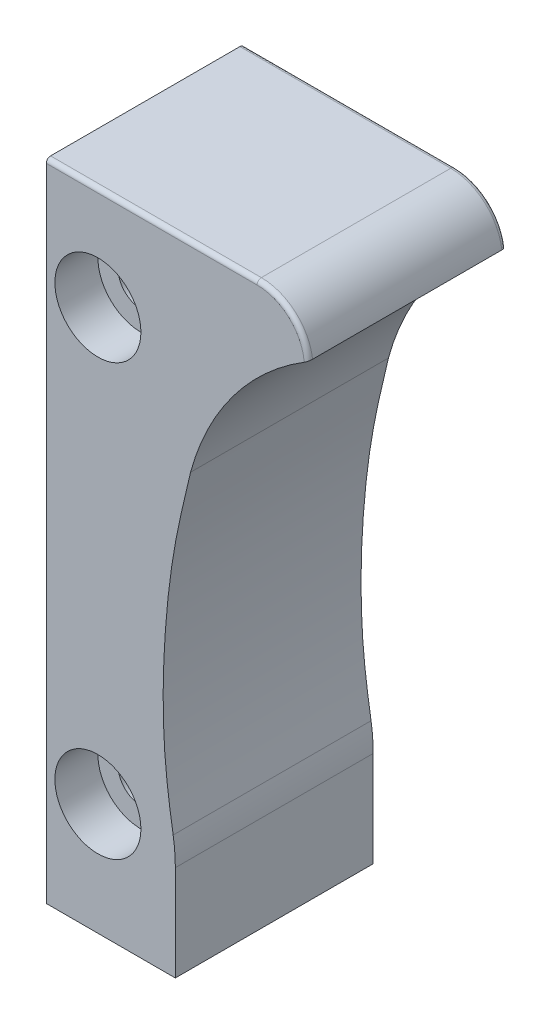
ISO-10303-21;
HEADER;
FILE_DESCRIPTION(('STEP AP214'),'2;1');
FILE_NAME('part.step','',(''),(''),'','','');
FILE_SCHEMA(('AUTOMOTIVE_DESIGN { 1 0 10303 214 1 1 1 1 }'));
ENDSEC;
DATA;
#1=APPLICATION_CONTEXT('core data for automotive mechanical design processes');
#2=APPLICATION_PROTOCOL_DEFINITION('international standard','automotive_design',2000,#1);
#3=PRODUCT_CONTEXT('',#1,'mechanical');
#4=PRODUCT('Part','Part','',(#3));
#5=PRODUCT_RELATED_PRODUCT_CATEGORY('part','',(#4));
#6=PRODUCT_DEFINITION_FORMATION('','',#4);
#7=PRODUCT_DEFINITION_CONTEXT('part definition',#1,'design');
#8=PRODUCT_DEFINITION('design','',#6,#7);
#9=PRODUCT_DEFINITION_SHAPE('','',#8);
#10=(LENGTH_UNIT() NAMED_UNIT(*) SI_UNIT(.MILLI.,.METRE.));
#11=(NAMED_UNIT(*) PLANE_ANGLE_UNIT() SI_UNIT($,.RADIAN.));
#12=(NAMED_UNIT(*) SI_UNIT($,.STERADIAN.) SOLID_ANGLE_UNIT());
#13=UNCERTAINTY_MEASURE_WITH_UNIT(LENGTH_MEASURE(1.E-05),#10,'distance_accuracy_value','');
#14=(GEOMETRIC_REPRESENTATION_CONTEXT(3) GLOBAL_UNCERTAINTY_ASSIGNED_CONTEXT((#13)) GLOBAL_UNIT_ASSIGNED_CONTEXT((#10,
#11,#12)) REPRESENTATION_CONTEXT('',''));
#15=CARTESIAN_POINT('',(0.,0.,0.));
#16=DIRECTION('',(0.,0.,1.));
#17=DIRECTION('',(1.,0.,0.));
#18=AXIS2_PLACEMENT_3D('',#15,#16,#17);
#19=CARTESIAN_POINT('',(24.5,69.,0.));
#20=DIRECTION('',(0.,0.,-1.));
#21=DIRECTION('',(-1.,0.,0.));
#22=AXIS2_PLACEMENT_3D('',#19,#20,#21);
#23=PLANE('',#22);
#24=CARTESIAN_POINT('',(5.99999999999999,13.,0.));
#25=DIRECTION('',(0.,0.,-1.));
#26=DIRECTION('',(-1.,0.,0.));
#27=AXIS2_PLACEMENT_3D('',#24,#25,#26);
#28=CIRCLE('',#27,4.99999999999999);
#29=CARTESIAN_POINT('',(1.,13.,0.));
#30=VERTEX_POINT('',#29);
#31=EDGE_CURVE('E614',#30,#30,#28,.T.);
#32=ORIENTED_EDGE('',*,*,#31,.F.);
#33=EDGE_LOOP('',(#32));
#34=FACE_BOUND('',#33,.T.);
#35=CARTESIAN_POINT('',(5.99999999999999,63.,0.));
#36=DIRECTION('',(0.,0.,-1.));
#37=DIRECTION('',(-1.,0.,0.));
#38=AXIS2_PLACEMENT_3D('',#35,#36,#37);
#39=CIRCLE('',#38,4.99999999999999);
#40=CARTESIAN_POINT('',(1.,63.,0.));
#41=VERTEX_POINT('',#40);
#42=EDGE_CURVE('E623',#41,#41,#39,.T.);
#43=ORIENTED_EDGE('',*,*,#42,.F.);
#44=EDGE_LOOP('',(#43));
#45=FACE_BOUND('',#44,.T.);
#46=CARTESIAN_POINT('',(16.769,51.79,0.));
#47=CARTESIAN_POINT('',(16.0926851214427,48.9656163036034,0.));
#48=CARTESIAN_POINT('',(14.6876697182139,43.0980792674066,0.));
#49=CARTESIAN_POINT('',(13.5098852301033,32.437096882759,0.));
#50=CARTESIAN_POINT('',(13.4642107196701,22.137856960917,0.));
#51=CARTESIAN_POINT('',(14.6088868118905,15.1139351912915,0.));
#52=CARTESIAN_POINT('',(15.,12.714,0.));
#53=B_SPLINE_CURVE_WITH_KNOTS('',3,(#46,#47,#48,#49,#50,#51,#52),.UNSPECIFIED.,.F.,.F.,(4,1,1,1,
4),(0.,0.220835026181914,0.458775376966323,0.8150742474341,1.),.UNSPECIFIED.);
#54=CARTESIAN_POINT('',(16.769,51.79,0.));
#55=VERTEX_POINT('',#54);
#56=CARTESIAN_POINT('',(14.7480328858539,14.2687484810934,0.));
#57=VERTEX_POINT('',#56);
#58=EDGE_CURVE('E467',#55,#57,#53,.T.);
#59=ORIENTED_EDGE('',*,*,#58,.T.);
#60=CARTESIAN_POINT('',(-4.99999999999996,11.1040688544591,0.));
#61=DIRECTION('',(0.,0.,-1.));
#62=DIRECTION('',(-1.,0.,0.));
#63=AXIS2_PLACEMENT_3D('',#60,#61,#62);
#64=CIRCLE('',#63,20.);
#65=CARTESIAN_POINT('',(15.,11.1040688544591,0.));
#66=VERTEX_POINT('',#65);
#67=EDGE_CURVE('E370',#57,#66,#64,.T.);
#68=ORIENTED_EDGE('',*,*,#67,.T.);
#69=DIRECTION('',(0.,-1.,0.));
#70=VECTOR('',#69,1.);
#71=CARTESIAN_POINT('',(15.,69.,0.));
#72=LINE('',#71,#70);
#73=CARTESIAN_POINT('',(15.,0.,0.));
#74=VERTEX_POINT('',#73);
#75=EDGE_CURVE('E471',#66,#74,#72,.T.);
#76=ORIENTED_EDGE('',*,*,#75,.T.);
#77=DIRECTION('',(1.,0.,0.));
#78=VECTOR('',#77,1.);
#79=CARTESIAN_POINT('',(0.,0.,0.));
#80=LINE('',#79,#78);
#81=CARTESIAN_POINT('',(0.,0.,0.));
#82=VERTEX_POINT('',#81);
#83=EDGE_CURVE('E444',#82,#74,#80,.T.);
#84=ORIENTED_EDGE('',*,*,#83,.F.);
#85=DIRECTION('',(0.,-1.,0.));
#86=VECTOR('',#85,1.);
#87=CARTESIAN_POINT('',(0.,0.,0.));
#88=LINE('',#87,#86);
#89=CARTESIAN_POINT('',(0.,74.5,0.));
#90=VERTEX_POINT('',#89);
#91=EDGE_CURVE('E445',#90,#82,#88,.T.);
#92=ORIENTED_EDGE('',*,*,#91,.F.);
#93=DIRECTION('',(-1.,0.,0.));
#94=VECTOR('',#93,1.);
#95=CARTESIAN_POINT('',(24.5,74.5,0.));
#96=LINE('',#95,#94);
#97=CARTESIAN_POINT('',(24.5,74.5,0.));
#98=VERTEX_POINT('',#97);
#99=EDGE_CURVE('E680',#90,#98,#96,.F.);
#100=ORIENTED_EDGE('',*,*,#99,.T.);
#101=CARTESIAN_POINT('',(24.5,69.,0.));
#102=DIRECTION('',(0.,0.,-1.));
#103=DIRECTION('',(-1.,0.,0.));
#104=AXIS2_PLACEMENT_3D('',#101,#102,#103);
#105=CIRCLE('',#104,5.5);
#106=CARTESIAN_POINT('',(29.9798054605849,69.4708843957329,0.));
#107=VERTEX_POINT('',#106);
#108=EDGE_CURVE('E679',#98,#107,#105,.T.);
#109=ORIENTED_EDGE('',*,*,#108,.T.);
#110=CARTESIAN_POINT('',(45.7218219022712,43.9328946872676,0.));
#111=DIRECTION('',(0.,0.,-1.));
#112=DIRECTION('',(-1.,0.,0.));
#113=AXIS2_PLACEMENT_3D('',#110,#111,#112);
#114=CIRCLE('',#113,30.);
#115=EDGE_CURVE('E465',#107,#55,#114,.F.);
#116=ORIENTED_EDGE('',*,*,#115,.T.);
#117=EDGE_LOOP('',(#59,#68,#76,#84,#92,#100,#109,#116));
#118=FACE_BOUND('',#117,.T.);
#119=ADVANCED_FACE('F348',(#34,#45,#118),#23,.T.);
#120=CARTESIAN_POINT('',(0.,0.,23.));
#121=DIRECTION('',(0.,1.,0.));
#122=DIRECTION('',(0.,0.,1.));
#123=AXIS2_PLACEMENT_3D('',#120,#121,#122);
#124=PLANE('',#123);
#125=DIRECTION('',(0.,0.,-1.));
#126=VECTOR('',#125,1.);
#127=CARTESIAN_POINT('',(15.,0.,23.));
#128=LINE('',#127,#126);
#129=CARTESIAN_POINT('',(15.,0.,23.));
#130=VERTEX_POINT('',#129);
#131=EDGE_CURVE('E430',#130,#74,#128,.T.);
#132=ORIENTED_EDGE('',*,*,#131,.F.);
#133=DIRECTION('',(1.,0.,0.));
#134=VECTOR('',#133,1.);
#135=CARTESIAN_POINT('',(0.,0.,23.));
#136=LINE('',#135,#134);
#137=CARTESIAN_POINT('',(0.,0.,23.));
#138=VERTEX_POINT('',#137);
#139=EDGE_CURVE('E441',#138,#130,#136,.T.);
#140=ORIENTED_EDGE('',*,*,#139,.F.);
#141=DIRECTION('',(0.,0.,-1.));
#142=VECTOR('',#141,1.);
#143=CARTESIAN_POINT('',(0.,0.,23.));
#144=LINE('',#143,#142);
#145=EDGE_CURVE('E463',#138,#82,#144,.T.);
#146=ORIENTED_EDGE('',*,*,#145,.T.);
#147=ORIENTED_EDGE('',*,*,#83,.T.);
#148=EDGE_LOOP('',(#132,#140,#146,#147));
#149=FACE_BOUND('',#148,.T.);
#150=ADVANCED_FACE('F439',(#149),#124,.F.);
#151=CARTESIAN_POINT('',(24.5,69.,23.));
#152=DIRECTION('',(0.,0.,-1.));
#153=DIRECTION('',(-1.,0.,0.));
#154=AXIS2_PLACEMENT_3D('',#151,#152,#153);
#155=PLANE('',#154);
#156=CARTESIAN_POINT('',(5.99999999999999,13.,23.));
#157=DIRECTION('',(0.,0.,1.));
#158=DIRECTION('',(1.,0.,0.));
#159=AXIS2_PLACEMENT_3D('',#156,#157,#158);
#160=CIRCLE('',#159,4.99999999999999);
#161=CARTESIAN_POINT('',(11.,13.,23.));
#162=VERTEX_POINT('',#161);
#163=EDGE_CURVE('E632',#162,#162,#160,.T.);
#164=ORIENTED_EDGE('',*,*,#163,.F.);
#165=EDGE_LOOP('',(#164));
#166=FACE_BOUND('',#165,.T.);
#167=CARTESIAN_POINT('',(5.99999999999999,63.,23.));
#168=DIRECTION('',(0.,0.,1.));
#169=DIRECTION('',(1.,0.,0.));
#170=AXIS2_PLACEMENT_3D('',#167,#168,#169);
#171=CIRCLE('',#170,4.99999999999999);
#172=CARTESIAN_POINT('',(11.,63.,23.));
#173=VERTEX_POINT('',#172);
#174=EDGE_CURVE('E641',#173,#173,#171,.T.);
#175=ORIENTED_EDGE('',*,*,#174,.F.);
#176=EDGE_LOOP('',(#175));
#177=FACE_BOUND('',#176,.T.);
#178=DIRECTION('',(0.,-1.,0.));
#179=VECTOR('',#178,1.);
#180=CARTESIAN_POINT('',(15.,12.714,23.));
#181=LINE('',#180,#179);
#182=CARTESIAN_POINT('',(15.,11.1040688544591,23.));
#183=VERTEX_POINT('',#182);
#184=EDGE_CURVE('E427',#183,#130,#181,.T.);
#185=ORIENTED_EDGE('',*,*,#184,.F.);
#186=CARTESIAN_POINT('',(-4.99999999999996,11.1040688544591,23.));
#187=DIRECTION('',(0.,0.,-1.));
#188=DIRECTION('',(-1.,0.,0.));
#189=AXIS2_PLACEMENT_3D('',#186,#187,#188);
#190=CIRCLE('',#189,20.);
#191=CARTESIAN_POINT('',(14.7480328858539,14.2687484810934,23.));
#192=VERTEX_POINT('',#191);
#193=EDGE_CURVE('E11',#183,#192,#190,.F.);
#194=ORIENTED_EDGE('',*,*,#193,.T.);
#195=CARTESIAN_POINT('',(16.769,51.79,23.));
#196=CARTESIAN_POINT('',(16.0926851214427,48.9656163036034,23.));
#197=CARTESIAN_POINT('',(14.6876697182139,43.0980792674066,23.));
#198=CARTESIAN_POINT('',(13.5098852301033,32.437096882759,23.));
#199=CARTESIAN_POINT('',(13.4642107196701,22.137856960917,23.));
#200=CARTESIAN_POINT('',(14.6088868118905,15.1139351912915,23.));
#201=CARTESIAN_POINT('',(15.,12.714,23.));
#202=B_SPLINE_CURVE_WITH_KNOTS('',3,(#195,#196,#197,#198,#199,#200,#201),.UNSPECIFIED.,.F.,.F.,
(4,1,1,1,4),(0.,0.220835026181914,0.458775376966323,0.8150742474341,1.),.UNSPECIFIED.);
#203=CARTESIAN_POINT('',(16.769,51.79,23.));
#204=VERTEX_POINT('',#203);
#205=EDGE_CURVE('E435',#204,#192,#202,.T.);
#206=ORIENTED_EDGE('',*,*,#205,.F.);
#207=CARTESIAN_POINT('',(45.7218219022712,43.9328946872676,23.));
#208=DIRECTION('',(0.,0.,1.));
#209=DIRECTION('',(1.,0.,0.));
#210=AXIS2_PLACEMENT_3D('',#207,#208,#209);
#211=CIRCLE('',#210,30.);
#212=CARTESIAN_POINT('',(29.9798054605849,69.4708843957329,23.));
#213=VERTEX_POINT('',#212);
#214=EDGE_CURVE('E643',#213,#204,#211,.T.);
#215=ORIENTED_EDGE('',*,*,#214,.F.);
#216=CARTESIAN_POINT('',(24.5,69.,23.));
#217=DIRECTION('',(0.,0.,-1.));
#218=DIRECTION('',(-1.,0.,0.));
#219=AXIS2_PLACEMENT_3D('',#216,#217,#218);
#220=CIRCLE('',#219,5.5);
#221=CARTESIAN_POINT('',(24.5,74.5,23.));
#222=VERTEX_POINT('',#221);
#223=EDGE_CURVE('E478',#213,#222,#220,.F.);
#224=ORIENTED_EDGE('',*,*,#223,.T.);
#225=DIRECTION('',(-1.,0.,0.));
#226=VECTOR('',#225,1.);
#227=CARTESIAN_POINT('',(24.5,74.5,23.));
#228=LINE('',#227,#226);
#229=CARTESIAN_POINT('',(0.,74.5,23.));
#230=VERTEX_POINT('',#229);
#231=EDGE_CURVE('E476',#222,#230,#228,.T.);
#232=ORIENTED_EDGE('',*,*,#231,.T.);
#233=DIRECTION('',(0.,-1.,0.));
#234=VECTOR('',#233,1.);
#235=CARTESIAN_POINT('',(0.,0.,23.));
#236=LINE('',#235,#234);
#237=EDGE_CURVE('E449',#230,#138,#236,.T.);
#238=ORIENTED_EDGE('',*,*,#237,.T.);
#239=ORIENTED_EDGE('',*,*,#139,.T.);
#240=EDGE_LOOP('',(#185,#194,#206,#215,#224,#232,#238,#239));
#241=FACE_BOUND('',#240,.T.);
#242=ADVANCED_FACE('F447',(#166,#177,#241),#155,.F.);
#243=CARTESIAN_POINT('',(0.,0.,23.));
#244=DIRECTION('',(1.,0.,0.));
#245=DIRECTION('',(0.,0.,-1.));
#246=AXIS2_PLACEMENT_3D('',#243,#244,#245);
#247=PLANE('',#246);
#248=ORIENTED_EDGE('',*,*,#237,.F.);
#249=CARTESIAN_POINT('',(0.,74.5,22.5));
#250=DIRECTION('',(1.,0.,0.));
#251=DIRECTION('',(0.,0.,-1.));
#252=AXIS2_PLACEMENT_3D('',#249,#250,#251);
#253=CIRCLE('',#252,0.5);
#254=CARTESIAN_POINT('',(0.,75.,22.5));
#255=VERTEX_POINT('',#254);
#256=EDGE_CURVE('E675',#230,#255,#253,.F.);
#257=ORIENTED_EDGE('',*,*,#256,.T.);
#258=DIRECTION('',(0.,0.,-1.));
#259=VECTOR('',#258,1.);
#260=CARTESIAN_POINT('',(0.,75.,23.));
#261=LINE('',#260,#259);
#262=CARTESIAN_POINT('',(0.,75.,0.5));
#263=VERTEX_POINT('',#262);
#264=EDGE_CURVE('E450',#255,#263,#261,.T.);
#265=ORIENTED_EDGE('',*,*,#264,.T.);
#266=CARTESIAN_POINT('',(0.,74.5,0.5));
#267=DIRECTION('',(1.,0.,0.));
#268=DIRECTION('',(0.,0.,-1.));
#269=AXIS2_PLACEMENT_3D('',#266,#267,#268);
#270=CIRCLE('',#269,0.5);
#271=EDGE_CURVE('E677',#263,#90,#270,.F.);
#272=ORIENTED_EDGE('',*,*,#271,.T.);
#273=ORIENTED_EDGE('',*,*,#91,.T.);
#274=ORIENTED_EDGE('',*,*,#145,.F.);
#275=EDGE_LOOP('',(#248,#257,#265,#272,#273,#274));
#276=FACE_BOUND('',#275,.T.);
#277=ADVANCED_FACE('F350',(#276),#247,.F.);
#278=CARTESIAN_POINT('',(24.5,69.,23.));
#279=DIRECTION('',(0.,0.,-1.));
#280=DIRECTION('',(-1.,0.,0.));
#281=AXIS2_PLACEMENT_3D('',#278,#279,#280);
#282=CYLINDRICAL_SURFACE('',#281,6.);
#283=DIRECTION('',(0.,0.,-1.));
#284=VECTOR('',#283,1.);
#285=CARTESIAN_POINT('',(24.5,75.,23.));
#286=LINE('',#285,#284);
#287=CARTESIAN_POINT('',(24.5,75.,22.5));
#288=VERTEX_POINT('',#287);
#289=CARTESIAN_POINT('',(24.5,75.,0.5));
#290=VERTEX_POINT('',#289);
#291=EDGE_CURVE('E453',#288,#290,#286,.T.);
#292=ORIENTED_EDGE('',*,*,#291,.F.);
#293=CARTESIAN_POINT('',(24.5,69.,22.5));
#294=DIRECTION('',(0.,0.,-1.));
#295=DIRECTION('',(-1.,0.,0.));
#296=AXIS2_PLACEMENT_3D('',#293,#294,#295);
#297=CIRCLE('',#296,6.);
#298=CARTESIAN_POINT('',(30.4521692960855,69.7560956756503,22.5));
#299=VERTEX_POINT('',#298);
#300=EDGE_CURVE('E484',#288,#299,#297,.T.);
#301=ORIENTED_EDGE('',*,*,#300,.T.);
#302=DIRECTION('',(0.,0.,-1.));
#303=VECTOR('',#302,1.);
#304=CARTESIAN_POINT('',(30.4521692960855,69.7560956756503,23.));
#305=LINE('',#304,#303);
#306=CARTESIAN_POINT('',(30.4521692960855,69.7560956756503,0.5));
#307=VERTEX_POINT('',#306);
#308=EDGE_CURVE('E460',#299,#307,#305,.T.);
#309=ORIENTED_EDGE('',*,*,#308,.T.);
#310=CARTESIAN_POINT('',(24.5,69.,0.5));
#311=DIRECTION('',(0.,0.,-1.));
#312=DIRECTION('',(-1.,0.,0.));
#313=AXIS2_PLACEMENT_3D('',#310,#311,#312);
#314=CIRCLE('',#313,6.);
#315=EDGE_CURVE('E481',#307,#290,#314,.F.);
#316=ORIENTED_EDGE('',*,*,#315,.T.);
#317=EDGE_LOOP('',(#292,#301,#309,#316));
#318=FACE_BOUND('',#317,.T.);
#319=ADVANCED_FACE('F584',(#318),#282,.T.);
#320=CARTESIAN_POINT('',(0.,75.,23.));
#321=DIRECTION('',(0.,-1.,0.));
#322=DIRECTION('',(0.,0.,-1.));
#323=AXIS2_PLACEMENT_3D('',#320,#321,#322);
#324=PLANE('',#323);
#325=ORIENTED_EDGE('',*,*,#264,.F.);
#326=DIRECTION('',(-1.,0.,0.));
#327=VECTOR('',#326,1.);
#328=CARTESIAN_POINT('',(0.,75.,22.5));
#329=LINE('',#328,#327);
#330=EDGE_CURVE('E603',#255,#288,#329,.F.);
#331=ORIENTED_EDGE('',*,*,#330,.T.);
#332=ORIENTED_EDGE('',*,*,#291,.T.);
#333=DIRECTION('',(-1.,0.,0.));
#334=VECTOR('',#333,1.);
#335=CARTESIAN_POINT('',(0.,75.,0.5));
#336=LINE('',#335,#334);
#337=EDGE_CURVE('E671',#290,#263,#336,.T.);
#338=ORIENTED_EDGE('',*,*,#337,.T.);
#339=EDGE_LOOP('',(#325,#331,#332,#338));
#340=FACE_BOUND('',#339,.T.);
#341=ADVANCED_FACE('F566',(#340),#324,.F.);
#342=CARTESIAN_POINT('',(15.,12.714,23.));
#343=DIRECTION('',(1.,0.,0.));
#344=DIRECTION('',(0.,1.,0.));
#345=AXIS2_PLACEMENT_3D('',#342,#343,#344);
#346=PLANE('',#345);
#347=ORIENTED_EDGE('',*,*,#75,.F.);
#348=DIRECTION('',(0.,0.,-1.));
#349=VECTOR('',#348,1.);
#350=CARTESIAN_POINT('',(15.,11.1040688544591,23.));
#351=LINE('',#350,#349);
#352=EDGE_CURVE('E356',#66,#183,#351,.F.);
#353=ORIENTED_EDGE('',*,*,#352,.T.);
#354=ORIENTED_EDGE('',*,*,#184,.T.);
#355=ORIENTED_EDGE('',*,*,#131,.T.);
#356=EDGE_LOOP('',(#347,#353,#354,#355));
#357=FACE_BOUND('',#356,.T.);
#358=ADVANCED_FACE('F429',(#357),#346,.T.);
#359=DIRECTION('',(0.,0.,-1.));
#360=VECTOR('',#359,1.);
#361=SURFACE_OF_LINEAR_EXTRUSION('',#202,#360);
#362=ORIENTED_EDGE('',*,*,#205,.T.);
#363=DIRECTION('',(0.,0.,-1.));
#364=VECTOR('',#363,1.);
#365=CARTESIAN_POINT('',(14.7480328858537,14.2687484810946,23.));
#366=LINE('',#365,#364);
#367=EDGE_CURVE('E665',#192,#57,#366,.T.);
#368=ORIENTED_EDGE('',*,*,#367,.T.);
#369=ORIENTED_EDGE('',*,*,#58,.F.);
#370=DIRECTION('',(0.,0.,-1.));
#371=VECTOR('',#370,1.);
#372=CARTESIAN_POINT('',(16.769,51.79,23.));
#373=LINE('',#372,#371);
#374=EDGE_CURVE('E646',#204,#55,#373,.T.);
#375=ORIENTED_EDGE('',*,*,#374,.F.);
#376=EDGE_LOOP('',(#362,#368,#369,#375));
#377=FACE_BOUND('',#376,.T.);
#378=ADVANCED_FACE('F564',(#377),#361,.T.);
#379=CARTESIAN_POINT('',(45.7218219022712,43.9328946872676,23.));
#380=DIRECTION('',(0.,0.,-1.));
#381=DIRECTION('',(-1.,0.,0.));
#382=AXIS2_PLACEMENT_3D('',#379,#380,#381);
#383=CYLINDRICAL_SURFACE('',#382,30.);
#384=ORIENTED_EDGE('',*,*,#308,.F.);
#385=CARTESIAN_POINT('',(30.4521692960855,69.7560956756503,22.5));
#386=CARTESIAN_POINT('',(30.452197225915,69.7561110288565,22.5264099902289));
#387=CARTESIAN_POINT('',(30.4502093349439,69.7549367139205,22.5528011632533));
#388=CARTESIAN_POINT('',(30.4424201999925,69.7503291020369,22.6047379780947));
#389=CARTESIAN_POINT('',(30.4366298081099,69.746902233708,22.6302858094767));
#390=CARTESIAN_POINT('',(30.4214535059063,69.737909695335,22.6798806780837));
#391=CARTESIAN_POINT('',(30.4120684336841,69.7323445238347,22.7039280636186));
#392=CARTESIAN_POINT('',(30.3900684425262,69.7192767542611,22.7499301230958));
#393=CARTESIAN_POINT('',(30.3774522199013,69.7117733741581,22.7718839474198));
#394=CARTESIAN_POINT('',(30.3490020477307,69.6948179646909,22.8138365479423));
#395=CARTESIAN_POINT('',(30.3330818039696,69.6853135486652,22.8337554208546));
#396=CARTESIAN_POINT('',(30.2988055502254,69.6648002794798,22.8704673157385));
#397=CARTESIAN_POINT('',(30.2804491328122,69.653791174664,22.8872598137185));
#398=CARTESIAN_POINT('',(30.2403308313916,69.629665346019,22.9186435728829));
#399=CARTESIAN_POINT('',(30.218415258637,69.616451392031,22.9329632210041));
#400=CARTESIAN_POINT('',(30.1729930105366,69.5889783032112,22.9575233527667));
#401=CARTESIAN_POINT('',(30.1494849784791,69.5747182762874,22.9677603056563));
#402=CARTESIAN_POINT('',(30.1017936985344,69.5456938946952,22.9839728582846));
#403=CARTESIAN_POINT('',(30.077622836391,69.5309382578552,22.9900009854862));
#404=CARTESIAN_POINT('',(30.0288908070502,69.5010926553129,22.9980137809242));
#405=CARTESIAN_POINT('',(30.0043305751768,69.4860034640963,23.0000069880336));
#406=CARTESIAN_POINT('',(29.9798054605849,69.4708843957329,23.));
#407=B_SPLINE_CURVE_WITH_KNOTS('',3,(#385,#386,#387,#388,#389,#390,#391,#392,#393,#394,#395,
#396,#397,#398,#399,#400,#401,#402,#403,#404,#405,#406),.UNSPECIFIED.,.F.,.F.,(4,2,2,2,2,2,2,2,
2,2,4),(0.,0.0791000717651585,0.157975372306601,0.236832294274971,0.315721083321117,
0.397012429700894,0.478317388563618,0.565926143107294,0.653610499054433,0.740179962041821,
0.826566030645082),.UNSPECIFIED.);
#408=EDGE_CURVE('E493',#299,#213,#407,.T.);
#409=ORIENTED_EDGE('',*,*,#408,.T.);
#410=ORIENTED_EDGE('',*,*,#214,.T.);
#411=ORIENTED_EDGE('',*,*,#374,.T.);
#412=ORIENTED_EDGE('',*,*,#115,.F.);
#413=CARTESIAN_POINT('',(29.9798054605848,69.4708843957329,0.));
#414=CARTESIAN_POINT('',(30.008568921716,69.4886173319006,-1.48751817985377E-05));
#415=CARTESIAN_POINT('',(30.0373895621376,69.5063131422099,0.0027322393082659));
#416=CARTESIAN_POINT('',(30.094406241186,69.5411934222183,0.0137796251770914));
#417=CARTESIAN_POINT('',(30.1225996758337,69.5583758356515,0.0220997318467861));
#418=CARTESIAN_POINT('',(30.1774691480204,69.5916970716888,0.0443485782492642));
#419=CARTESIAN_POINT('',(30.2041414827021,69.6078333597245,0.0582903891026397));
#420=CARTESIAN_POINT('',(30.2548897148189,69.6384365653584,0.0915984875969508));
#421=CARTESIAN_POINT('',(30.278969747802,69.6529061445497,0.110955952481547));
#422=CARTESIAN_POINT('',(30.3218979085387,69.6786307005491,0.153088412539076));
#423=CARTESIAN_POINT('',(30.3410008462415,69.6900440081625,0.175506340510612));
#424=CARTESIAN_POINT('',(30.3753077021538,69.7104993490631,0.224121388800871));
#425=CARTESIAN_POINT('',(30.3905119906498,69.7195416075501,0.250318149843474));
#426=CARTESIAN_POINT('',(30.4150167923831,69.7340942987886,0.302977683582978));
#427=CARTESIAN_POINT('',(30.4247449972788,69.7398610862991,0.32917161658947));
#428=CARTESIAN_POINT('',(30.4399484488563,69.7488669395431,0.383153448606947));
#429=CARTESIAN_POINT('',(30.4454322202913,69.7521110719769,0.410938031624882));
#430=CARTESIAN_POINT('',(30.4498364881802,69.7547161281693,0.449142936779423));
#431=CARTESIAN_POINT('',(30.4507113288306,69.7552335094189,0.459295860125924));
#432=CARTESIAN_POINT('',(30.4518769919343,69.7559228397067,0.4796307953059));
#433=CARTESIAN_POINT('',(30.4521687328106,69.7560953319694,0.489812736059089));
#434=CARTESIAN_POINT('',(30.4521692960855,69.7560956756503,0.499999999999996));
#435=B_SPLINE_CURVE_WITH_KNOTS('',3,(#413,#414,#415,#416,#417,#418,#419,#420,#421,#422,#423,
#424,#425,#426,#427,#428,#429,#430,#431,#432,#433,#434),.UNSPECIFIED.,.F.,.F.,(4,2,2,2,2,2,2,2,
2,2,4),(0.,0.101306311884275,0.20297512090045,0.304881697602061,0.406623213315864,
0.500865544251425,0.595098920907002,0.680252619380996,0.765234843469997,0.795828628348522,
0.826374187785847),.UNSPECIFIED.);
#436=EDGE_CURVE('E486',#107,#307,#435,.T.);
#437=ORIENTED_EDGE('',*,*,#436,.T.);
#438=EDGE_LOOP('',(#384,#409,#410,#411,#412,#437));
#439=FACE_BOUND('',#438,.T.);
#440=ADVANCED_FACE('F499',(#439),#383,.F.);
#441=CARTESIAN_POINT('',(5.99999999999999,63.,23.));
#442=DIRECTION('',(0.,0.,1.));
#443=DIRECTION('',(1.,0.,0.));
#444=AXIS2_PLACEMENT_3D('',#441,#442,#443);
#445=CYLINDRICAL_SURFACE('',#444,5.);
#446=CARTESIAN_POINT('',(5.99999999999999,63.,18.));
#447=DIRECTION('',(0.,0.,1.));
#448=DIRECTION('',(1.,0.,0.));
#449=AXIS2_PLACEMENT_3D('',#446,#447,#448);
#450=CIRCLE('',#449,5.);
#451=CARTESIAN_POINT('',(11.,63.,18.));
#452=VERTEX_POINT('',#451);
#453=EDGE_CURVE('E638',#452,#452,#450,.T.);
#454=ORIENTED_EDGE('',*,*,#453,.F.);
#455=EDGE_LOOP('',(#454));
#456=FACE_BOUND('',#455,.T.);
#457=ORIENTED_EDGE('',*,*,#174,.T.);
#458=EDGE_LOOP('',(#457));
#459=FACE_BOUND('',#458,.T.);
#460=ADVANCED_FACE('F556',(#456,#459),#445,.F.);
#461=CARTESIAN_POINT('',(8.65,63.,18.));
#462=DIRECTION('',(0.,0.,-1.));
#463=DIRECTION('',(-1.,0.,0.));
#464=AXIS2_PLACEMENT_3D('',#461,#462,#463);
#465=PLANE('',#464);
#466=CARTESIAN_POINT('',(5.99999999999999,63.,18.));
#467=DIRECTION('',(0.,0.,1.));
#468=DIRECTION('',(1.,0.,0.));
#469=AXIS2_PLACEMENT_3D('',#466,#467,#468);
#470=CIRCLE('',#469,2.65);
#471=CARTESIAN_POINT('',(8.65,63.,18.));
#472=VERTEX_POINT('',#471);
#473=EDGE_CURVE('E635',#472,#472,#470,.T.);
#474=ORIENTED_EDGE('',*,*,#473,.F.);
#475=EDGE_LOOP('',(#474));
#476=FACE_BOUND('',#475,.T.);
#477=ORIENTED_EDGE('',*,*,#453,.T.);
#478=EDGE_LOOP('',(#477));
#479=FACE_BOUND('',#478,.T.);
#480=ADVANCED_FACE('F553',(#476,#479),#465,.F.);
#481=CARTESIAN_POINT('',(5.99999999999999,63.,23.));
#482=DIRECTION('',(0.,0.,1.));
#483=DIRECTION('',(1.,0.,0.));
#484=AXIS2_PLACEMENT_3D('',#481,#482,#483);
#485=CYLINDRICAL_SURFACE('',#484,2.65);
#486=CARTESIAN_POINT('',(5.99999999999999,63.,5.));
#487=DIRECTION('',(0.,0.,-1.));
#488=DIRECTION('',(-1.,0.,0.));
#489=AXIS2_PLACEMENT_3D('',#486,#487,#488);
#490=CIRCLE('',#489,2.64999999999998);
#491=CARTESIAN_POINT('',(3.35000000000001,63.,5.));
#492=VERTEX_POINT('',#491);
#493=EDGE_CURVE('E617',#492,#492,#490,.T.);
#494=ORIENTED_EDGE('',*,*,#493,.T.);
#495=EDGE_LOOP('',(#494));
#496=FACE_BOUND('',#495,.T.);
#497=ORIENTED_EDGE('',*,*,#473,.T.);
#498=EDGE_LOOP('',(#497));
#499=FACE_BOUND('',#498,.T.);
#500=ADVANCED_FACE('F549',(#496,#499),#485,.F.);
#501=CARTESIAN_POINT('',(5.99999999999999,13.,23.));
#502=DIRECTION('',(0.,0.,1.));
#503=DIRECTION('',(1.,0.,0.));
#504=AXIS2_PLACEMENT_3D('',#501,#502,#503);
#505=CYLINDRICAL_SURFACE('',#504,5.);
#506=CARTESIAN_POINT('',(5.99999999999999,13.,18.));
#507=DIRECTION('',(0.,0.,1.));
#508=DIRECTION('',(1.,0.,0.));
#509=AXIS2_PLACEMENT_3D('',#506,#507,#508);
#510=CIRCLE('',#509,5.);
#511=CARTESIAN_POINT('',(11.,13.,18.));
#512=VERTEX_POINT('',#511);
#513=EDGE_CURVE('E629',#512,#512,#510,.T.);
#514=ORIENTED_EDGE('',*,*,#513,.F.);
#515=EDGE_LOOP('',(#514));
#516=FACE_BOUND('',#515,.T.);
#517=ORIENTED_EDGE('',*,*,#163,.T.);
#518=EDGE_LOOP('',(#517));
#519=FACE_BOUND('',#518,.T.);
#520=ADVANCED_FACE('F545',(#516,#519),#505,.F.);
#521=CARTESIAN_POINT('',(8.65,13.,18.));
#522=DIRECTION('',(0.,0.,-1.));
#523=DIRECTION('',(-1.,0.,0.));
#524=AXIS2_PLACEMENT_3D('',#521,#522,#523);
#525=PLANE('',#524);
#526=CARTESIAN_POINT('',(5.99999999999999,13.,18.));
#527=DIRECTION('',(0.,0.,1.));
#528=DIRECTION('',(1.,0.,0.));
#529=AXIS2_PLACEMENT_3D('',#526,#527,#528);
#530=CIRCLE('',#529,2.65);
#531=CARTESIAN_POINT('',(8.65,13.,18.));
#532=VERTEX_POINT('',#531);
#533=EDGE_CURVE('E626',#532,#532,#530,.T.);
#534=ORIENTED_EDGE('',*,*,#533,.F.);
#535=EDGE_LOOP('',(#534));
#536=FACE_BOUND('',#535,.T.);
#537=ORIENTED_EDGE('',*,*,#513,.T.);
#538=EDGE_LOOP('',(#537));
#539=FACE_BOUND('',#538,.T.);
#540=ADVANCED_FACE('F541',(#536,#539),#525,.F.);
#541=CARTESIAN_POINT('',(5.99999999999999,13.,23.));
#542=DIRECTION('',(0.,0.,1.));
#543=DIRECTION('',(1.,0.,0.));
#544=AXIS2_PLACEMENT_3D('',#541,#542,#543);
#545=CYLINDRICAL_SURFACE('',#544,2.65);
#546=CARTESIAN_POINT('',(5.99999999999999,13.,5.));
#547=DIRECTION('',(0.,0.,-1.));
#548=DIRECTION('',(-1.,0.,0.));
#549=AXIS2_PLACEMENT_3D('',#546,#547,#548);
#550=CIRCLE('',#549,2.64999999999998);
#551=CARTESIAN_POINT('',(3.35000000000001,13.,5.));
#552=VERTEX_POINT('',#551);
#553=EDGE_CURVE('E604',#552,#552,#550,.T.);
#554=ORIENTED_EDGE('',*,*,#553,.T.);
#555=EDGE_LOOP('',(#554));
#556=FACE_BOUND('',#555,.T.);
#557=ORIENTED_EDGE('',*,*,#533,.T.);
#558=EDGE_LOOP('',(#557));
#559=FACE_BOUND('',#558,.T.);
#560=ADVANCED_FACE('F537',(#556,#559),#545,.F.);
#561=CARTESIAN_POINT('',(5.99999999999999,63.,0.));
#562=DIRECTION('',(0.,0.,-1.));
#563=DIRECTION('',(-1.,0.,0.));
#564=AXIS2_PLACEMENT_3D('',#561,#562,#563);
#565=CYLINDRICAL_SURFACE('',#564,5.);
#566=CARTESIAN_POINT('',(5.99999999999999,63.,5.));
#567=DIRECTION('',(0.,0.,-1.));
#568=DIRECTION('',(-1.,0.,0.));
#569=AXIS2_PLACEMENT_3D('',#566,#567,#568);
#570=CIRCLE('',#569,5.);
#571=CARTESIAN_POINT('',(0.999999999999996,63.,5.));
#572=VERTEX_POINT('',#571);
#573=EDGE_CURVE('E620',#572,#572,#570,.T.);
#574=ORIENTED_EDGE('',*,*,#573,.F.);
#575=EDGE_LOOP('',(#574));
#576=FACE_BOUND('',#575,.T.);
#577=ORIENTED_EDGE('',*,*,#42,.T.);
#578=EDGE_LOOP('',(#577));
#579=FACE_BOUND('',#578,.T.);
#580=ADVANCED_FACE('F533',(#576,#579),#565,.F.);
#581=CARTESIAN_POINT('',(8.64999999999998,63.,5.));
#582=DIRECTION('',(0.,0.,1.));
#583=DIRECTION('',(1.,0.,0.));
#584=AXIS2_PLACEMENT_3D('',#581,#582,#583);
#585=PLANE('',#584);
#586=ORIENTED_EDGE('',*,*,#493,.F.);
#587=EDGE_LOOP('',(#586));
#588=FACE_BOUND('',#587,.T.);
#589=ORIENTED_EDGE('',*,*,#573,.T.);
#590=EDGE_LOOP('',(#589));
#591=FACE_BOUND('',#590,.T.);
#592=ADVANCED_FACE('F529',(#588,#591),#585,.F.);
#593=CARTESIAN_POINT('',(5.99999999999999,13.,0.));
#594=DIRECTION('',(0.,0.,-1.));
#595=DIRECTION('',(-1.,0.,0.));
#596=AXIS2_PLACEMENT_3D('',#593,#594,#595);
#597=CYLINDRICAL_SURFACE('',#596,5.);
#598=CARTESIAN_POINT('',(5.99999999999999,13.,5.));
#599=DIRECTION('',(0.,0.,-1.));
#600=DIRECTION('',(-1.,0.,0.));
#601=AXIS2_PLACEMENT_3D('',#598,#599,#600);
#602=CIRCLE('',#601,5.);
#603=CARTESIAN_POINT('',(0.999999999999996,13.,5.));
#604=VERTEX_POINT('',#603);
#605=EDGE_CURVE('E608',#604,#604,#602,.T.);
#606=ORIENTED_EDGE('',*,*,#605,.F.);
#607=EDGE_LOOP('',(#606));
#608=FACE_BOUND('',#607,.T.);
#609=ORIENTED_EDGE('',*,*,#31,.T.);
#610=EDGE_LOOP('',(#609));
#611=FACE_BOUND('',#610,.T.);
#612=ADVANCED_FACE('F525',(#608,#611),#597,.F.);
#613=CARTESIAN_POINT('',(8.64999999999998,13.,5.));
#614=DIRECTION('',(0.,0.,1.));
#615=DIRECTION('',(1.,0.,0.));
#616=AXIS2_PLACEMENT_3D('',#613,#614,#615);
#617=PLANE('',#616);
#618=ORIENTED_EDGE('',*,*,#553,.F.);
#619=EDGE_LOOP('',(#618));
#620=FACE_BOUND('',#619,.T.);
#621=ORIENTED_EDGE('',*,*,#605,.T.);
#622=EDGE_LOOP('',(#621));
#623=FACE_BOUND('',#622,.T.);
#624=ADVANCED_FACE('F521',(#620,#623),#617,.F.);
#625=CARTESIAN_POINT('',(24.5,74.5,22.5));
#626=DIRECTION('',(-1.,0.,0.));
#627=DIRECTION('',(0.,0.,1.));
#628=AXIS2_PLACEMENT_3D('',#625,#626,#627);
#629=CYLINDRICAL_SURFACE('',#628,0.5);
#630=ORIENTED_EDGE('',*,*,#256,.F.);
#631=ORIENTED_EDGE('',*,*,#231,.F.);
#632=CARTESIAN_POINT('',(24.5,74.5,22.5));
#633=DIRECTION('',(1.,0.,0.));
#634=DIRECTION('',(0.,0.,-1.));
#635=AXIS2_PLACEMENT_3D('',#632,#633,#634);
#636=CIRCLE('',#635,0.5);
#637=EDGE_CURVE('E599',#288,#222,#636,.T.);
#638=ORIENTED_EDGE('',*,*,#637,.F.);
#639=ORIENTED_EDGE('',*,*,#330,.F.);
#640=EDGE_LOOP('',(#630,#631,#638,#639));
#641=FACE_BOUND('',#640,.T.);
#642=ADVANCED_FACE('F517',(#641),#629,.T.);
#643=CARTESIAN_POINT('',(24.5,69.,22.5));
#644=DIRECTION('',(0.,0.,-1.));
#645=DIRECTION('',(-1.,0.,0.));
#646=AXIS2_PLACEMENT_3D('',#643,#644,#645);
#647=TOROIDAL_SURFACE('',#646,5.5,0.5);
#648=ORIENTED_EDGE('',*,*,#408,.F.);
#649=ORIENTED_EDGE('',*,*,#300,.F.);
#650=ORIENTED_EDGE('',*,*,#637,.T.);
#651=ORIENTED_EDGE('',*,*,#223,.F.);
#652=EDGE_LOOP('',(#648,#649,#650,#651));
#653=FACE_BOUND('',#652,.T.);
#654=ADVANCED_FACE('F512',(#653),#647,.T.);
#655=CARTESIAN_POINT('',(0.,74.5,0.5));
#656=DIRECTION('',(1.,0.,0.));
#657=DIRECTION('',(0.,0.,-1.));
#658=AXIS2_PLACEMENT_3D('',#655,#656,#657);
#659=CYLINDRICAL_SURFACE('',#658,0.5);
#660=ORIENTED_EDGE('',*,*,#271,.F.);
#661=ORIENTED_EDGE('',*,*,#337,.F.);
#662=CARTESIAN_POINT('',(24.5,74.5,0.5));
#663=DIRECTION('',(1.,0.,0.));
#664=DIRECTION('',(0.,0.,-1.));
#665=AXIS2_PLACEMENT_3D('',#662,#663,#664);
#666=CIRCLE('',#665,0.5);
#667=EDGE_CURVE('E605',#98,#290,#666,.T.);
#668=ORIENTED_EDGE('',*,*,#667,.F.);
#669=ORIENTED_EDGE('',*,*,#99,.F.);
#670=EDGE_LOOP('',(#660,#661,#668,#669));
#671=FACE_BOUND('',#670,.T.);
#672=ADVANCED_FACE('F509',(#671),#659,.T.);
#673=CARTESIAN_POINT('',(24.5,69.,0.5));
#674=DIRECTION('',(0.,0.,-1.));
#675=DIRECTION('',(-1.,0.,0.));
#676=AXIS2_PLACEMENT_3D('',#673,#674,#675);
#677=TOROIDAL_SURFACE('',#676,5.5,0.5);
#678=ORIENTED_EDGE('',*,*,#436,.F.);
#679=ORIENTED_EDGE('',*,*,#108,.F.);
#680=ORIENTED_EDGE('',*,*,#667,.T.);
#681=ORIENTED_EDGE('',*,*,#315,.F.);
#682=EDGE_LOOP('',(#678,#679,#680,#681));
#683=FACE_BOUND('',#682,.T.);
#684=ADVANCED_FACE('F503',(#683),#677,.T.);
#685=CARTESIAN_POINT('',(-4.99999999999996,11.1040688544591,11.5));
#686=DIRECTION('',(0.,0.,-1.));
#687=DIRECTION('',(-1.,0.,0.));
#688=AXIS2_PLACEMENT_3D('',#685,#686,#687);
#689=CYLINDRICAL_SURFACE('',#688,20.);
#690=ORIENTED_EDGE('',*,*,#193,.F.);
#691=ORIENTED_EDGE('',*,*,#352,.F.);
#692=ORIENTED_EDGE('',*,*,#67,.F.);
#693=ORIENTED_EDGE('',*,*,#367,.F.);
#694=EDGE_LOOP('',(#690,#691,#692,#693));
#695=FACE_BOUND('',#694,.T.);
#696=ADVANCED_FACE('F508',(#695),#689,.T.);
#697=CLOSED_SHELL('',(#119,#150,#242,#277,#319,#341,#358,#378,#440,#460,#480,#500,#520,#540,
#560,#580,#592,#612,#624,#642,#654,#672,#684,#696));
#698=MANIFOLD_SOLID_BREP('B2',#697);
#699=ADVANCED_BREP_SHAPE_REPRESENTATION('',(#18,#698),#14);
#700=SHAPE_DEFINITION_REPRESENTATION(#9,#699);
ENDSEC;
END-ISO-10303-21;
